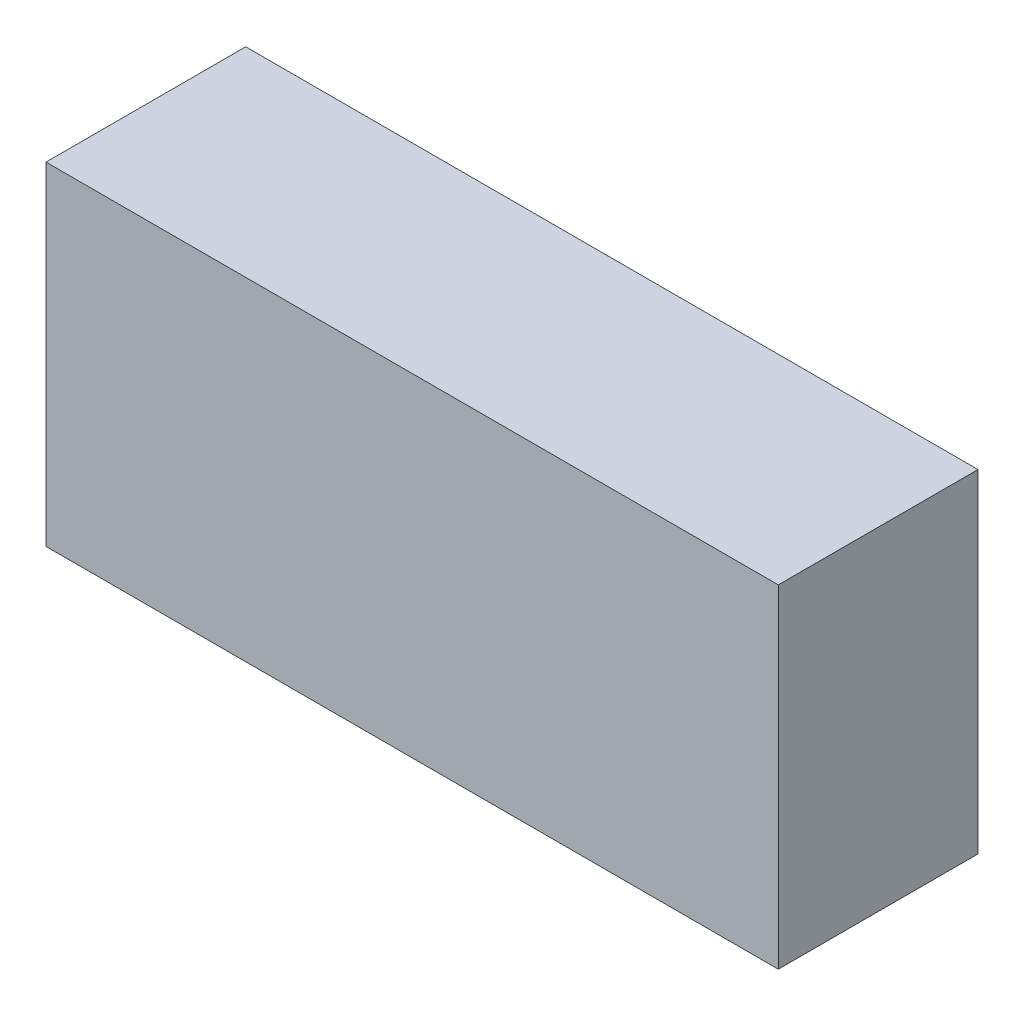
from build123d import *

# Parameters (mm, degrees)
SKETCH2_W           = 139.7
SKETCH2_H           = 38.1
BOSS_EXTRUDE1_DEPTH = 63.5


with BuildPart() as part:
    # Sketch2 → Boss-Extrude1 (new body)
    with BuildSketch(Plane(origin=(0, 0, 0), x_dir=(1, 0, 0), z_dir=(0, 1, 0))):
        Rectangle(SKETCH2_W, SKETCH2_H)
    extrude(amount=BOSS_EXTRUDE1_DEPTH)


solid = part.part
